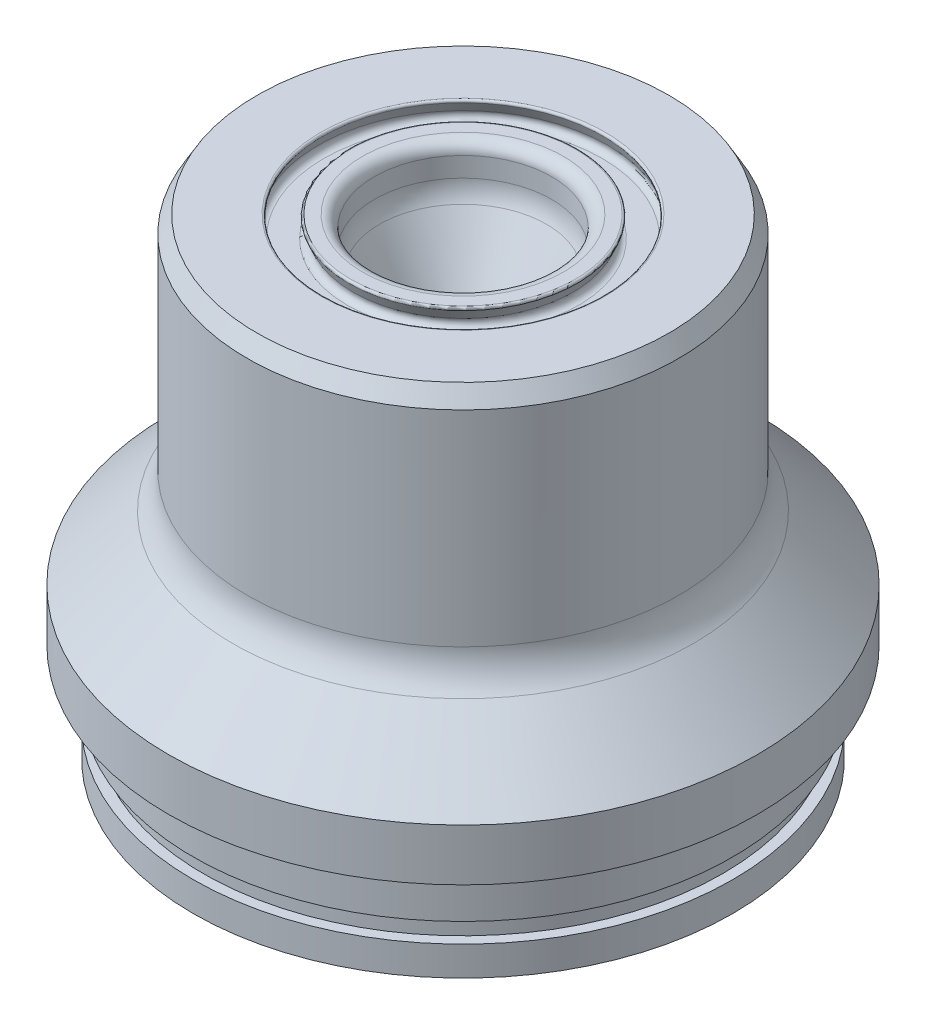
ISO-10303-21;
HEADER;
FILE_DESCRIPTION(('STEP AP214'),'2;1');
FILE_NAME('part.step','',(''),(''),'','','');
FILE_SCHEMA(('AUTOMOTIVE_DESIGN { 1 0 10303 214 1 1 1 1 }'));
ENDSEC;
DATA;
#1=APPLICATION_CONTEXT('core data for automotive mechanical design processes');
#2=APPLICATION_PROTOCOL_DEFINITION('international standard','automotive_design',2000,#1);
#3=PRODUCT_CONTEXT('',#1,'mechanical');
#4=PRODUCT('Part','Part','',(#3));
#5=PRODUCT_RELATED_PRODUCT_CATEGORY('part','',(#4));
#6=PRODUCT_DEFINITION_FORMATION('','',#4);
#7=PRODUCT_DEFINITION_CONTEXT('part definition',#1,'design');
#8=PRODUCT_DEFINITION('design','',#6,#7);
#9=PRODUCT_DEFINITION_SHAPE('','',#8);
#10=(LENGTH_UNIT() NAMED_UNIT(*) SI_UNIT(.MILLI.,.METRE.));
#11=(NAMED_UNIT(*) PLANE_ANGLE_UNIT() SI_UNIT($,.RADIAN.));
#12=(NAMED_UNIT(*) SI_UNIT($,.STERADIAN.) SOLID_ANGLE_UNIT());
#13=UNCERTAINTY_MEASURE_WITH_UNIT(LENGTH_MEASURE(1.E-05),#10,'distance_accuracy_value','');
#14=(GEOMETRIC_REPRESENTATION_CONTEXT(3) GLOBAL_UNCERTAINTY_ASSIGNED_CONTEXT((#13)) GLOBAL_UNIT_ASSIGNED_CONTEXT((#10,
#11,#12)) REPRESENTATION_CONTEXT('',''));
#15=CARTESIAN_POINT('',(0.,0.,0.));
#16=DIRECTION('',(0.,0.,1.));
#17=DIRECTION('',(1.,0.,0.));
#18=AXIS2_PLACEMENT_3D('',#15,#16,#17);
#19=CARTESIAN_POINT('',(-17.4625,-24.638,0.));
#20=DIRECTION('',(0.,-1.,0.));
#21=DIRECTION('',(1.,0.,0.));
#22=AXIS2_PLACEMENT_3D('',#19,#20,#21);
#23=PLANE('',#22);
#24=CARTESIAN_POINT('',(0.,-24.638,0.));
#25=DIRECTION('',(0.,1.,0.));
#26=DIRECTION('',(-1.,0.,0.));
#27=AXIS2_PLACEMENT_3D('',#24,#25,#26);
#28=CIRCLE('',#27,19.05);
#29=CARTESIAN_POINT('',(-19.05,-24.638,0.));
#30=VERTEX_POINT('',#29);
#31=EDGE_CURVE('E151',#30,#30,#28,.T.);
#32=ORIENTED_EDGE('',*,*,#31,.F.);
#33=EDGE_LOOP('',(#32));
#34=FACE_BOUND('',#33,.T.);
#35=CARTESIAN_POINT('',(0.,-24.638,0.));
#36=DIRECTION('',(0.,1.,0.));
#37=DIRECTION('',(-1.,0.,0.));
#38=AXIS2_PLACEMENT_3D('',#35,#36,#37);
#39=CIRCLE('',#38,17.4625);
#40=CARTESIAN_POINT('',(-17.4392920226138,-24.638,0.9));
#41=VERTEX_POINT('',#40);
#42=CARTESIAN_POINT('',(-17.4392920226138,-24.638,-0.899999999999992));
#43=VERTEX_POINT('',#42);
#44=EDGE_CURVE('E149',#41,#43,#39,.T.);
#45=ORIENTED_EDGE('',*,*,#44,.T.);
#46=DIRECTION('',(1.,0.,0.));
#47=VECTOR('',#46,1.);
#48=CARTESIAN_POINT('',(-18.05,-24.638,-0.9));
#49=LINE('',#48,#47);
#50=CARTESIAN_POINT('',(-18.05,-24.638,-0.9));
#51=VERTEX_POINT('',#50);
#52=EDGE_CURVE('E64',#51,#43,#49,.T.);
#53=ORIENTED_EDGE('',*,*,#52,.F.);
#54=CARTESIAN_POINT('',(-18.05,-24.638,0.));
#55=DIRECTION('',(0.,-1.,0.));
#56=DIRECTION('',(1.,0.,0.));
#57=AXIS2_PLACEMENT_3D('',#54,#55,#56);
#58=CIRCLE('',#57,0.9);
#59=CARTESIAN_POINT('',(-18.05,-24.638,0.9));
#60=VERTEX_POINT('',#59);
#61=EDGE_CURVE('E69',#60,#51,#58,.T.);
#62=ORIENTED_EDGE('',*,*,#61,.F.);
#63=DIRECTION('',(-1.,0.,0.));
#64=VECTOR('',#63,1.);
#65=CARTESIAN_POINT('',(-18.05,-24.638,0.9));
#66=LINE('',#65,#64);
#67=EDGE_CURVE('E106',#41,#60,#66,.T.);
#68=ORIENTED_EDGE('',*,*,#67,.F.);
#69=EDGE_LOOP('',(#45,#53,#62,#68));
#70=FACE_BOUND('',#69,.T.);
#71=ADVANCED_FACE('F49',(#34,#70),#23,.T.);
#72=CARTESIAN_POINT('',(0.,0.,0.));
#73=DIRECTION('',(0.,1.,0.));
#74=DIRECTION('',(-1.,0.,0.));
#75=AXIS2_PLACEMENT_3D('',#72,#73,#74);
#76=CYLINDRICAL_SURFACE('',#75,17.4625);
#77=CARTESIAN_POINT('',(0.,-27.813,0.));
#78=DIRECTION('',(0.,1.,0.));
#79=DIRECTION('',(-1.,0.,0.));
#80=AXIS2_PLACEMENT_3D('',#77,#78,#79);
#81=CIRCLE('',#80,17.4625);
#82=CARTESIAN_POINT('',(-17.4392920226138,-27.813,0.9));
#83=VERTEX_POINT('',#82);
#84=CARTESIAN_POINT('',(-17.4392920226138,-27.813,-0.899999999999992));
#85=VERTEX_POINT('',#84);
#86=EDGE_CURVE('E147',#83,#85,#81,.T.);
#87=ORIENTED_EDGE('',*,*,#86,.T.);
#88=DIRECTION('',(0.,1.,0.));
#89=VECTOR('',#88,1.);
#90=CARTESIAN_POINT('',(-17.4392920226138,-27.813,-0.899999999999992));
#91=LINE('',#90,#89);
#92=EDGE_CURVE('E95',#85,#43,#91,.T.);
#93=ORIENTED_EDGE('',*,*,#92,.T.);
#94=ORIENTED_EDGE('',*,*,#44,.F.);
#95=DIRECTION('',(0.,1.,0.));
#96=VECTOR('',#95,1.);
#97=CARTESIAN_POINT('',(-17.4392920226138,-27.813,0.9));
#98=LINE('',#97,#96);
#99=EDGE_CURVE('E114',#83,#41,#98,.T.);
#100=ORIENTED_EDGE('',*,*,#99,.F.);
#101=EDGE_LOOP('',(#87,#93,#94,#100));
#102=FACE_BOUND('',#101,.T.);
#103=ADVANCED_FACE('F235',(#102),#76,.T.);
#104=CARTESIAN_POINT('',(0.,-16.2052,0.));
#105=DIRECTION('',(0.,1.,0.));
#106=DIRECTION('',(0.,0.,1.));
#107=AXIS2_PLACEMENT_3D('',#104,#105,#106);
#108=PLANE('',#107);
#109=CARTESIAN_POINT('',(0.,-16.2052,0.));
#110=DIRECTION('',(0.,1.,0.));
#111=DIRECTION('',(0.,0.,1.));
#112=AXIS2_PLACEMENT_3D('',#109,#110,#111);
#113=CIRCLE('',#112,7.74764143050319);
#114=CARTESIAN_POINT('',(0.,-16.2052,7.74764143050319));
#115=VERTEX_POINT('',#114);
#116=EDGE_CURVE('E217',#115,#115,#113,.F.);
#117=ORIENTED_EDGE('',*,*,#116,.T.);
#118=EDGE_LOOP('',(#117));
#119=FACE_BOUND('',#118,.T.);
#120=CARTESIAN_POINT('',(0.,-16.2052,0.));
#121=DIRECTION('',(0.,1.,0.));
#122=DIRECTION('',(0.,0.,1.));
#123=AXIS2_PLACEMENT_3D('',#120,#121,#122);
#124=CIRCLE('',#123,2.51123484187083);
#125=CARTESIAN_POINT('',(0.,-16.2052,2.51123484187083));
#126=VERTEX_POINT('',#125);
#127=EDGE_CURVE('E202',#126,#126,#124,.T.);
#128=ORIENTED_EDGE('',*,*,#127,.T.);
#129=EDGE_LOOP('',(#128));
#130=FACE_BOUND('',#129,.T.);
#131=ADVANCED_FACE('F241',(#119,#130),#108,.F.);
#132=CARTESIAN_POINT('',(0.,-0.508000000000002,0.));
#133=DIRECTION('',(0.,1.,0.));
#134=DIRECTION('',(0.,0.,1.));
#135=AXIS2_PLACEMENT_3D('',#132,#133,#134);
#136=CYLINDRICAL_SURFACE('',#135,13.97);
#137=CARTESIAN_POINT('',(0.,-14.8900719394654,0.));
#138=DIRECTION('',(0.,1.,0.));
#139=DIRECTION('',(-1.,0.,0.));
#140=AXIS2_PLACEMENT_3D('',#137,#138,#139);
#141=CIRCLE('',#140,13.97);
#142=CARTESIAN_POINT('',(-13.97,-14.8900719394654,0.));
#143=VERTEX_POINT('',#142);
#144=EDGE_CURVE('E208',#143,#143,#141,.T.);
#145=ORIENTED_EDGE('',*,*,#144,.T.);
#146=EDGE_LOOP('',(#145));
#147=FACE_BOUND('',#146,.T.);
#148=CARTESIAN_POINT('',(0.,-1.60785226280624,0.));
#149=DIRECTION('',(0.,-1.,0.));
#150=DIRECTION('',(0.,0.,-1.));
#151=AXIS2_PLACEMENT_3D('',#148,#149,#150);
#152=CIRCLE('',#151,13.97);
#153=CARTESIAN_POINT('',(0.,-1.60785226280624,-13.97));
#154=VERTEX_POINT('',#153);
#155=EDGE_CURVE('E199',#154,#154,#152,.T.);
#156=ORIENTED_EDGE('',*,*,#155,.T.);
#157=EDGE_LOOP('',(#156));
#158=FACE_BOUND('',#157,.T.);
#159=ADVANCED_FACE('F315',(#147,#158),#136,.T.);
#160=CARTESIAN_POINT('',(9.19986285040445,-0.508000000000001,0.));
#161=DIRECTION('',(0.,-1.,0.));
#162=DIRECTION('',(0.,0.,-1.));
#163=AXIS2_PLACEMENT_3D('',#160,#161,#162);
#164=PLANE('',#163);
#165=CARTESIAN_POINT('',(0.,-0.508000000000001,0.));
#166=DIRECTION('',(0.,-1.,0.));
#167=DIRECTION('',(0.,0.,-1.));
#168=AXIS2_PLACEMENT_3D('',#165,#166,#167);
#169=CIRCLE('',#168,13.335);
#170=CARTESIAN_POINT('',(0.,-0.508000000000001,-13.335));
#171=VERTEX_POINT('',#170);
#172=EDGE_CURVE('E196',#171,#171,#169,.F.);
#173=ORIENTED_EDGE('',*,*,#172,.T.);
#174=EDGE_LOOP('',(#173));
#175=FACE_BOUND('',#174,.T.);
#176=CARTESIAN_POINT('',(0.,-0.508,0.));
#177=DIRECTION('',(0.,1.,0.));
#178=DIRECTION('',(0.,0.,1.));
#179=AXIS2_PLACEMENT_3D('',#176,#177,#178);
#180=CIRCLE('',#179,9.19986285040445);
#181=CARTESIAN_POINT('',(0.,-0.508,9.19986285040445));
#182=VERTEX_POINT('',#181);
#183=EDGE_CURVE('E193',#182,#182,#180,.T.);
#184=ORIENTED_EDGE('',*,*,#183,.F.);
#185=EDGE_LOOP('',(#184));
#186=FACE_BOUND('',#185,.T.);
#187=ADVANCED_FACE('F311',(#175,#186),#164,.F.);
#188=CARTESIAN_POINT('',(0.,-0.635,0.));
#189=DIRECTION('',(0.,1.,0.));
#190=DIRECTION('',(0.,0.,1.));
#191=AXIS2_PLACEMENT_3D('',#188,#189,#190);
#192=TOROIDAL_SURFACE('',#191,9.19986285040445,0.127);
#193=CARTESIAN_POINT('',(0.,-0.686655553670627,0.));
#194=DIRECTION('',(0.,1.,0.));
#195=DIRECTION('',(0.,0.,1.));
#196=AXIS2_PLACEMENT_3D('',#193,#194,#195);
#197=CIRCLE('',#196,9.08384257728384);
#198=CARTESIAN_POINT('',(0.,-0.686655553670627,9.08384257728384));
#199=VERTEX_POINT('',#198);
#200=EDGE_CURVE('E190',#199,#199,#197,.T.);
#201=ORIENTED_EDGE('',*,*,#200,.F.);
#202=EDGE_LOOP('',(#201));
#203=FACE_BOUND('',#202,.T.);
#204=ORIENTED_EDGE('',*,*,#183,.T.);
#205=EDGE_LOOP('',(#204));
#206=FACE_BOUND('',#205,.T.);
#207=ADVANCED_FACE('F307',(#203,#206),#192,.T.);
#208=CARTESIAN_POINT('',(0.,-0.686655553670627,0.));
#209=DIRECTION('',(0.,-1.,0.));
#210=DIRECTION('',(0.,0.,-1.));
#211=AXIS2_PLACEMENT_3D('',#208,#209,#210);
#212=CONICAL_SURFACE('',#211,9.08384257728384,0.418879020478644);
#213=CARTESIAN_POINT('',(0.,-1.32130139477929,0.));
#214=DIRECTION('',(0.,1.,0.));
#215=DIRECTION('',(0.,0.,1.));
#216=AXIS2_PLACEMENT_3D('',#213,#214,#215);
#217=CIRCLE('',#216,9.36640511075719);
#218=CARTESIAN_POINT('',(0.,-1.32130139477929,9.36640511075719));
#219=VERTEX_POINT('',#218);
#220=EDGE_CURVE('E187',#219,#219,#217,.T.);
#221=ORIENTED_EDGE('',*,*,#220,.F.);
#222=EDGE_LOOP('',(#221));
#223=FACE_BOUND('',#222,.T.);
#224=ORIENTED_EDGE('',*,*,#200,.T.);
#225=EDGE_LOOP('',(#224));
#226=FACE_BOUND('',#225,.T.);
#227=ADVANCED_FACE('F303',(#223,#226),#212,.F.);
#228=CARTESIAN_POINT('',(0.,-1.482725,0.));
#229=DIRECTION('',(0.,1.,0.));
#230=DIRECTION('',(0.,0.,1.));
#231=AXIS2_PLACEMENT_3D('',#228,#229,#230);
#232=TOROIDAL_SURFACE('',#231,9.00384175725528,0.396875);
#233=CARTESIAN_POINT('',(0.,-1.8796,0.));
#234=DIRECTION('',(0.,1.,0.));
#235=DIRECTION('',(0.,0.,1.));
#236=AXIS2_PLACEMENT_3D('',#233,#234,#235);
#237=CIRCLE('',#236,9.00384175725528);
#238=CARTESIAN_POINT('',(0.,-1.8796,9.00384175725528));
#239=VERTEX_POINT('',#238);
#240=EDGE_CURVE('E184',#239,#239,#237,.T.);
#241=ORIENTED_EDGE('',*,*,#240,.F.);
#242=EDGE_LOOP('',(#241));
#243=FACE_BOUND('',#242,.T.);
#244=ORIENTED_EDGE('',*,*,#220,.T.);
#245=EDGE_LOOP('',(#244));
#246=FACE_BOUND('',#245,.T.);
#247=ADVANCED_FACE('F299',(#243,#246),#232,.F.);
#248=CARTESIAN_POINT('',(9.00384175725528,-1.8796,0.));
#249=DIRECTION('',(0.,-1.,0.));
#250=DIRECTION('',(0.,0.,-1.));
#251=AXIS2_PLACEMENT_3D('',#248,#249,#250);
#252=PLANE('',#251);
#253=CARTESIAN_POINT('',(0.,-1.8796,0.));
#254=DIRECTION('',(0.,1.,0.));
#255=DIRECTION('',(0.,0.,1.));
#256=AXIS2_PLACEMENT_3D('',#253,#254,#255);
#257=CIRCLE('',#256,7.48075824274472);
#258=CARTESIAN_POINT('',(0.,-1.8796,7.48075824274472));
#259=VERTEX_POINT('',#258);
#260=EDGE_CURVE('E181',#259,#259,#257,.T.);
#261=ORIENTED_EDGE('',*,*,#260,.F.);
#262=EDGE_LOOP('',(#261));
#263=FACE_BOUND('',#262,.T.);
#264=ORIENTED_EDGE('',*,*,#240,.T.);
#265=EDGE_LOOP('',(#264));
#266=FACE_BOUND('',#265,.T.);
#267=ADVANCED_FACE('F295',(#263,#266),#252,.F.);
#268=CARTESIAN_POINT('',(0.,-1.482725,0.));
#269=DIRECTION('',(0.,1.,0.));
#270=DIRECTION('',(0.,0.,1.));
#271=AXIS2_PLACEMENT_3D('',#268,#269,#270);
#272=TOROIDAL_SURFACE('',#271,7.48075824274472,0.396875);
#273=CARTESIAN_POINT('',(0.,-1.32130139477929,0.));
#274=DIRECTION('',(0.,1.,0.));
#275=DIRECTION('',(0.,0.,1.));
#276=AXIS2_PLACEMENT_3D('',#273,#274,#275);
#277=CIRCLE('',#276,7.11819488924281);
#278=CARTESIAN_POINT('',(0.,-1.32130139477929,7.11819488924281));
#279=VERTEX_POINT('',#278);
#280=EDGE_CURVE('E178',#279,#279,#277,.T.);
#281=ORIENTED_EDGE('',*,*,#280,.F.);
#282=EDGE_LOOP('',(#281));
#283=FACE_BOUND('',#282,.T.);
#284=ORIENTED_EDGE('',*,*,#260,.T.);
#285=EDGE_LOOP('',(#284));
#286=FACE_BOUND('',#285,.T.);
#287=ADVANCED_FACE('F291',(#283,#286),#272,.F.);
#288=CARTESIAN_POINT('',(0.,-1.32130139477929,0.));
#289=DIRECTION('',(0.,1.,0.));
#290=DIRECTION('',(0.,0.,1.));
#291=AXIS2_PLACEMENT_3D('',#288,#289,#290);
#292=CONICAL_SURFACE('',#291,7.11819488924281,0.418879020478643);
#293=CARTESIAN_POINT('',(0.,-0.686655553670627,0.));
#294=DIRECTION('',(0.,1.,0.));
#295=DIRECTION('',(0.,0.,1.));
#296=AXIS2_PLACEMENT_3D('',#293,#294,#295);
#297=CIRCLE('',#296,7.40075742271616);
#298=CARTESIAN_POINT('',(0.,-0.686655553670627,7.40075742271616));
#299=VERTEX_POINT('',#298);
#300=EDGE_CURVE('E175',#299,#299,#297,.T.);
#301=ORIENTED_EDGE('',*,*,#300,.F.);
#302=EDGE_LOOP('',(#301));
#303=FACE_BOUND('',#302,.T.);
#304=ORIENTED_EDGE('',*,*,#280,.T.);
#305=EDGE_LOOP('',(#304));
#306=FACE_BOUND('',#305,.T.);
#307=ADVANCED_FACE('F287',(#303,#306),#292,.T.);
#308=CARTESIAN_POINT('',(0.,-0.635,0.));
#309=DIRECTION('',(0.,1.,0.));
#310=DIRECTION('',(0.,0.,1.));
#311=AXIS2_PLACEMENT_3D('',#308,#309,#310);
#312=TOROIDAL_SURFACE('',#311,7.28473714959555,0.127);
#313=CARTESIAN_POINT('',(0.,-0.508,0.));
#314=DIRECTION('',(0.,1.,0.));
#315=DIRECTION('',(0.,0.,1.));
#316=AXIS2_PLACEMENT_3D('',#313,#314,#315);
#317=CIRCLE('',#316,7.28473714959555);
#318=CARTESIAN_POINT('',(0.,-0.508,7.28473714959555));
#319=VERTEX_POINT('',#318);
#320=EDGE_CURVE('E172',#319,#319,#317,.T.);
#321=ORIENTED_EDGE('',*,*,#320,.F.);
#322=EDGE_LOOP('',(#321));
#323=FACE_BOUND('',#322,.T.);
#324=ORIENTED_EDGE('',*,*,#300,.T.);
#325=EDGE_LOOP('',(#324));
#326=FACE_BOUND('',#325,.T.);
#327=ADVANCED_FACE('F283',(#323,#326),#312,.T.);
#328=CARTESIAN_POINT('',(7.28473714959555,-0.508000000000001,0.));
#329=DIRECTION('',(0.,-1.,0.));
#330=DIRECTION('',(0.,0.,-1.));
#331=AXIS2_PLACEMENT_3D('',#328,#329,#330);
#332=PLANE('',#331);
#333=CARTESIAN_POINT('',(0.,-0.508000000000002,0.));
#334=DIRECTION('',(0.,1.,0.));
#335=DIRECTION('',(0.,0.,1.));
#336=AXIS2_PLACEMENT_3D('',#333,#334,#335);
#337=CIRCLE('',#336,6.49878528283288);
#338=CARTESIAN_POINT('',(0.,-0.508000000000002,6.49878528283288));
#339=VERTEX_POINT('',#338);
#340=EDGE_CURVE('E169',#339,#339,#337,.T.);
#341=ORIENTED_EDGE('',*,*,#340,.F.);
#342=EDGE_LOOP('',(#341));
#343=FACE_BOUND('',#342,.T.);
#344=ORIENTED_EDGE('',*,*,#320,.T.);
#345=EDGE_LOOP('',(#344));
#346=FACE_BOUND('',#345,.T.);
#347=ADVANCED_FACE('F279',(#343,#346),#332,.F.);
#348=CARTESIAN_POINT('',(0.,-1.27,0.));
#349=DIRECTION('',(0.,1.,0.));
#350=DIRECTION('',(0.,0.,1.));
#351=AXIS2_PLACEMENT_3D('',#348,#349,#350);
#352=TOROIDAL_SURFACE('',#351,6.49878528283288,0.761999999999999);
#353=CARTESIAN_POINT('',(0.,-1.27,0.));
#354=DIRECTION('',(0.,1.,0.));
#355=DIRECTION('',(0.,0.,1.));
#356=AXIS2_PLACEMENT_3D('',#353,#354,#355);
#357=CIRCLE('',#356,5.73678528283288);
#358=CARTESIAN_POINT('',(0.,-1.27,5.73678528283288));
#359=VERTEX_POINT('',#358);
#360=EDGE_CURVE('E166',#359,#359,#357,.T.);
#361=ORIENTED_EDGE('',*,*,#360,.F.);
#362=EDGE_LOOP('',(#361));
#363=FACE_BOUND('',#362,.T.);
#364=ORIENTED_EDGE('',*,*,#340,.T.);
#365=EDGE_LOOP('',(#364));
#366=FACE_BOUND('',#365,.T.);
#367=ADVANCED_FACE('F275',(#363,#366),#352,.T.);
#368=CARTESIAN_POINT('',(0.,-0.508000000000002,0.));
#369=DIRECTION('',(0.,1.,0.));
#370=DIRECTION('',(0.,0.,1.));
#371=AXIS2_PLACEMENT_3D('',#368,#369,#370);
#372=CYLINDRICAL_SURFACE('',#371,5.73678528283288);
#373=CARTESIAN_POINT('',(0.,-2.54,0.));
#374=DIRECTION('',(0.,1.,0.));
#375=DIRECTION('',(0.,0.,1.));
#376=AXIS2_PLACEMENT_3D('',#373,#374,#375);
#377=CIRCLE('',#376,5.73678528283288);
#378=CARTESIAN_POINT('',(0.,-2.54,5.73678528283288));
#379=VERTEX_POINT('',#378);
#380=EDGE_CURVE('E163',#379,#379,#377,.T.);
#381=ORIENTED_EDGE('',*,*,#380,.F.);
#382=EDGE_LOOP('',(#381));
#383=FACE_BOUND('',#382,.T.);
#384=ORIENTED_EDGE('',*,*,#360,.T.);
#385=EDGE_LOOP('',(#384));
#386=FACE_BOUND('',#385,.T.);
#387=ADVANCED_FACE('F271',(#383,#386),#372,.F.);
#388=CARTESIAN_POINT('',(0.,-2.54,0.));
#389=DIRECTION('',(0.,1.,0.));
#390=DIRECTION('',(0.,0.,1.));
#391=AXIS2_PLACEMENT_3D('',#388,#389,#390);
#392=TOROIDAL_SURFACE('',#391,3.19678528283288,2.54);
#393=CARTESIAN_POINT('',(0.,-3.77909119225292,0.));
#394=DIRECTION('',(0.,1.,0.));
#395=DIRECTION('',(0.,0.,1.));
#396=AXIS2_PLACEMENT_3D('',#393,#394,#395);
#397=CIRCLE('',#396,5.41404778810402);
#398=CARTESIAN_POINT('',(0.,-3.77909119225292,5.41404778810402));
#399=VERTEX_POINT('',#398);
#400=EDGE_CURVE('E160',#399,#399,#397,.T.);
#401=ORIENTED_EDGE('',*,*,#400,.F.);
#402=EDGE_LOOP('',(#401));
#403=FACE_BOUND('',#402,.T.);
#404=ORIENTED_EDGE('',*,*,#380,.T.);
#405=EDGE_LOOP('',(#404));
#406=FACE_BOUND('',#405,.T.);
#407=ADVANCED_FACE('F267',(#403,#406),#392,.F.);
#408=CARTESIAN_POINT('',(0.,-3.77909119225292,0.));
#409=DIRECTION('',(0.,1.,0.));
#410=DIRECTION('',(0.,0.,1.));
#411=AXIS2_PLACEMENT_3D('',#408,#409,#410);
#412=CONICAL_SURFACE('',#411,5.41404778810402,0.509603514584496);
#413=CARTESIAN_POINT('',(0.,-11.6945254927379,0.));
#414=DIRECTION('',(0.,-1.,0.));
#415=DIRECTION('',(0.,0.,-1.));
#416=AXIS2_PLACEMENT_3D('',#413,#414,#415);
#417=CIRCLE('',#416,0.9906);
#418=CARTESIAN_POINT('',(0.,-11.6945254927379,0.990600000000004));
#419=VERTEX_POINT('',#418);
#420=EDGE_CURVE('E157',#419,#419,#417,.F.);
#421=CARTESIAN_POINT('',(0.,-11.6945254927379,0.990600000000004));
#422=CARTESIAN_POINT('',(0.,-11.6120730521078,1.03667758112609));
#423=CARTESIAN_POINT('',(0.,-11.5296206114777,1.08275516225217));
#424=CARTESIAN_POINT('',(0.,-11.3647157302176,1.17491032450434));
#425=CARTESIAN_POINT('',(0.,-11.2822632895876,1.22098790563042));
#426=CARTESIAN_POINT('',(0.,-11.1173584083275,1.31314306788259));
#427=CARTESIAN_POINT('',(0.,-11.0349059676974,1.35922064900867));
#428=CARTESIAN_POINT('',(0.,-10.8700010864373,1.45137581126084));
#429=CARTESIAN_POINT('',(0.,-10.7875486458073,1.49745339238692));
#430=CARTESIAN_POINT('',(0.,-10.6226437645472,1.58960855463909));
#431=CARTESIAN_POINT('',(0.,-10.5401913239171,1.63568613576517));
#432=CARTESIAN_POINT('',(0.,-10.375286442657,1.72784129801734));
#433=CARTESIAN_POINT('',(0.,-10.292834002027,1.77391887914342));
#434=CARTESIAN_POINT('',(0.,-10.1279291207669,1.86607404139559));
#435=CARTESIAN_POINT('',(0.,-10.0454766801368,1.91215162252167));
#436=CARTESIAN_POINT('',(0.,-9.88057179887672,2.00430678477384));
#437=CARTESIAN_POINT('',(0.,-9.79811935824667,2.05038436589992));
#438=CARTESIAN_POINT('',(0.,-9.63321447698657,2.14253952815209));
#439=CARTESIAN_POINT('',(0.,-9.55076203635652,2.18861710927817));
#440=CARTESIAN_POINT('',(0.,-9.38585715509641,2.28077227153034));
#441=CARTESIAN_POINT('',(0.,-9.30340471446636,2.32684985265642));
#442=CARTESIAN_POINT('',(0.,-9.13849983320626,2.41900501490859));
#443=CARTESIAN_POINT('',(0.,-9.05604739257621,2.46508259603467));
#444=CARTESIAN_POINT('',(0.,-8.89114251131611,2.55723775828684));
#445=CARTESIAN_POINT('',(0.,-8.80869007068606,2.60331533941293));
#446=CARTESIAN_POINT('',(0.,-8.64378518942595,2.69547050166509));
#447=CARTESIAN_POINT('',(0.,-8.5613327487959,2.74154808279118));
#448=CARTESIAN_POINT('',(0.,-8.3964278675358,2.83370324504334));
#449=CARTESIAN_POINT('',(0.,-8.31397542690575,2.87978082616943));
#450=CARTESIAN_POINT('',(0.,-8.14907054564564,2.97193598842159));
#451=CARTESIAN_POINT('',(0.,-8.06661810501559,3.01801356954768));
#452=CARTESIAN_POINT('',(0.,-7.90171322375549,3.11016873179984));
#453=CARTESIAN_POINT('',(0.,-7.81926078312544,3.15624631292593));
#454=CARTESIAN_POINT('',(0.,-7.65435590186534,3.24840147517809));
#455=CARTESIAN_POINT('',(0.,-7.57190346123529,3.29447905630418));
#456=CARTESIAN_POINT('',(0.,-7.40699857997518,3.38663421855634));
#457=CARTESIAN_POINT('',(0.,-7.32454613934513,3.43271179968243));
#458=CARTESIAN_POINT('',(0.,-7.15964125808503,3.52486696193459));
#459=CARTESIAN_POINT('',(0.,-7.07718881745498,3.57094454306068));
#460=CARTESIAN_POINT('',(0.,-6.91228393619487,3.66309970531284));
#461=CARTESIAN_POINT('',(0.,-6.82983149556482,3.70917728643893));
#462=CARTESIAN_POINT('',(0.,-6.66492661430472,3.80133244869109));
#463=CARTESIAN_POINT('',(0.,-6.58247417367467,3.84741002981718));
#464=CARTESIAN_POINT('',(0.,-6.41756929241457,3.93956519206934));
#465=CARTESIAN_POINT('',(0.,-6.33511685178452,3.98564277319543));
#466=CARTESIAN_POINT('',(0.,-6.17021197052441,4.0777979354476));
#467=CARTESIAN_POINT('',(0.,-6.08775952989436,4.12387551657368));
#468=CARTESIAN_POINT('',(0.,-5.92285464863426,4.21603067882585));
#469=CARTESIAN_POINT('',(0.,-5.84040220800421,4.26210825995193));
#470=CARTESIAN_POINT('',(0.,-5.67549732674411,4.3542634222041));
#471=CARTESIAN_POINT('',(0.,-5.59304488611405,4.40034100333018));
#472=CARTESIAN_POINT('',(0.,-5.42814000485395,4.49249616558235));
#473=CARTESIAN_POINT('',(0.,-5.3456875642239,4.53857374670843));
#474=CARTESIAN_POINT('',(0.,-5.1807826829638,4.6307289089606));
#475=CARTESIAN_POINT('',(0.,-5.09833024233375,4.67680649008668));
#476=CARTESIAN_POINT('',(0.,-4.93342536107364,4.76896165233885));
#477=CARTESIAN_POINT('',(0.,-4.85097292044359,4.81503923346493));
#478=CARTESIAN_POINT('',(0.,-4.68606803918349,4.9071943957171));
#479=CARTESIAN_POINT('',(0.,-4.60361559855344,4.95327197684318));
#480=CARTESIAN_POINT('',(0.,-4.43871071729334,5.04542713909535));
#481=CARTESIAN_POINT('',(0.,-4.35625827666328,5.09150472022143));
#482=CARTESIAN_POINT('',(0.,-4.19135339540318,5.1836598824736));
#483=CARTESIAN_POINT('',(0.,-4.10890095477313,5.22973746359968));
#484=CARTESIAN_POINT('',(0.,-3.94399607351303,5.32189262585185));
#485=CARTESIAN_POINT('',(0.,-3.86154363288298,5.36797020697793));
#486=CARTESIAN_POINT('',(0.,-3.77909119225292,5.41404778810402));
#487=B_SPLINE_CURVE_WITH_KNOTS('',3,(#421,#422,#423,#424,#425,#426,#427,#428,#429,#430,#431,
#432,#433,#434,#435,#436,#437,#438,#439,#440,#441,#442,#443,#444,#445,#446,#447,#448,#449,#450,
#451,#452,#453,#454,#455,#456,#457,#458,#459,#460,#461,#462,#463,#464,#465,#466,#467,#468,#469,
#470,#471,#472,#473,#474,#475,#476,#477,#478,#479,#480,#481,#482,#483,#484,#485,#486),
.UNSPECIFIED.,.F.,.F.,(4,2,2,2,2,2,2,2,2,2,2,2,2,2,2,2,2,2,2,2,2,2,2,2,2,2,2,2,2,2,2,2,4),(0.,
0.283361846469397,0.566723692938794,0.850085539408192,1.13344738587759,1.41680923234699,
1.70017107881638,1.98353292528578,2.26689477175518,2.55025661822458,2.83361846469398,
3.11698031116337,3.40034215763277,3.68370400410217,3.96706585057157,4.25042769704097,
4.53378954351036,4.81715138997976,5.10051323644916,5.38387508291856,5.66723692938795,
5.95059877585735,6.23396062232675,6.51732246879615,6.80068431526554,7.08404616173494,
7.36740800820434,7.65076985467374,7.93413170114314,8.21749354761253,8.50085539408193,
8.78421724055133,9.06757908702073),.UNSPECIFIED.);
#488=EDGE_CURVE('BSEAM263',#419,#399,#487,.T.);
#489=ORIENTED_EDGE('',*,*,#420,.F.);
#490=ORIENTED_EDGE('',*,*,#400,.T.);
#491=ORIENTED_EDGE('',*,*,#488,.T.);
#492=ORIENTED_EDGE('',*,*,#488,.F.);
#493=EDGE_LOOP('',(#489,#491,#490,#492));
#494=FACE_BOUND('',#493,.T.);
#495=ADVANCED_FACE('F263',(#494),#412,.F.);
#496=CARTESIAN_POINT('',(0.,-6.69452549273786,0.));
#497=DIRECTION('',(0.,-1.,0.));
#498=DIRECTION('',(1.,0.,0.));
#499=AXIS2_PLACEMENT_3D('',#496,#497,#498);
#500=CYLINDRICAL_SURFACE('',#499,0.9906);
#501=ORIENTED_EDGE('',*,*,#420,.T.);
#502=EDGE_LOOP('',(#501));
#503=FACE_BOUND('',#502,.T.);
#504=CARTESIAN_POINT('',(0.,-25.3492,0.));
#505=DIRECTION('',(0.,1.,0.));
#506=DIRECTION('',(-1.,0.,0.));
#507=AXIS2_PLACEMENT_3D('',#504,#505,#506);
#508=CIRCLE('',#507,0.990599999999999);
#509=CARTESIAN_POINT('',(-0.990599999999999,-25.3492,0.));
#510=VERTEX_POINT('',#509);
#511=EDGE_CURVE('E109',#510,#510,#508,.T.);
#512=ORIENTED_EDGE('',*,*,#511,.F.);
#513=EDGE_LOOP('',(#512));
#514=FACE_BOUND('',#513,.T.);
#515=ADVANCED_FACE('F260',(#503,#514),#500,.F.);
#516=CARTESIAN_POINT('',(0.,-0.508000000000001,0.));
#517=DIRECTION('',(0.,-1.,0.));
#518=DIRECTION('',(0.,0.,-1.));
#519=AXIS2_PLACEMENT_3D('',#516,#517,#518);
#520=CONICAL_SURFACE('',#519,13.335,0.5235987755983);
#521=ORIENTED_EDGE('',*,*,#155,.F.);
#522=EDGE_LOOP('',(#521));
#523=FACE_BOUND('',#522,.T.);
#524=ORIENTED_EDGE('',*,*,#172,.F.);
#525=EDGE_LOOP('',(#524));
#526=FACE_BOUND('',#525,.T.);
#527=ADVANCED_FACE('F258',(#523,#526),#520,.T.);
#528=CARTESIAN_POINT('',(0.,-21.0673024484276,0.));
#529=DIRECTION('',(0.,-1.,0.));
#530=DIRECTION('',(1.,0.,0.));
#531=AXIS2_PLACEMENT_3D('',#528,#529,#530);
#532=CONICAL_SURFACE('',#531,15.24,0.78539816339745);
#533=CARTESIAN_POINT('',(0.,-19.2074305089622,0.));
#534=DIRECTION('',(0.,-1.,0.));
#535=DIRECTION('',(1.,0.,0.));
#536=AXIS2_PLACEMENT_3D('',#533,#534,#535);
#537=CIRCLE('',#536,13.3801280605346);
#538=CARTESIAN_POINT('',(13.3801280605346,-19.2074305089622,0.));
#539=VERTEX_POINT('',#538);
#540=EDGE_CURVE('E12',#539,#539,#537,.T.);
#541=ORIENTED_EDGE('',*,*,#540,.T.);
#542=EDGE_LOOP('',(#541));
#543=FACE_BOUND('',#542,.T.);
#544=CARTESIAN_POINT('',(0.,-18.0650719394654,0.));
#545=DIRECTION('',(0.,1.,0.));
#546=DIRECTION('',(0.,0.,1.));
#547=AXIS2_PLACEMENT_3D('',#544,#545,#546);
#548=CIRCLE('',#547,12.2377694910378);
#549=CARTESIAN_POINT('',(0.,-18.0650719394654,12.2377694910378));
#550=VERTEX_POINT('',#549);
#551=EDGE_CURVE('E214',#550,#550,#548,.T.);
#552=ORIENTED_EDGE('',*,*,#551,.T.);
#553=EDGE_LOOP('',(#552));
#554=FACE_BOUND('',#553,.T.);
#555=ADVANCED_FACE('F254',(#543,#554),#532,.F.);
#556=CARTESIAN_POINT('',(0.,-16.2052,0.));
#557=DIRECTION('',(0.,-1.,0.));
#558=DIRECTION('',(1.,0.,0.));
#559=AXIS2_PLACEMENT_3D('',#556,#557,#558);
#560=CONICAL_SURFACE('',#559,13.97,0.78539816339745);
#561=CARTESIAN_POINT('',(0.,-17.1351359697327,0.));
#562=DIRECTION('',(0.,1.,0.));
#563=DIRECTION('',(-1.,0.,0.));
#564=AXIS2_PLACEMENT_3D('',#561,#562,#563);
#565=CIRCLE('',#564,14.8999359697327);
#566=CARTESIAN_POINT('',(-14.8999359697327,-17.1351359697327,0.));
#567=VERTEX_POINT('',#566);
#568=EDGE_CURVE('E211',#567,#567,#565,.F.);
#569=ORIENTED_EDGE('',*,*,#568,.T.);
#570=EDGE_LOOP('',(#569));
#571=FACE_BOUND('',#570,.T.);
#572=CARTESIAN_POINT('',(0.,-21.2852,0.));
#573=DIRECTION('',(0.,1.,0.));
#574=DIRECTION('',(-1.,0.,0.));
#575=AXIS2_PLACEMENT_3D('',#572,#573,#574);
#576=CIRCLE('',#575,19.05);
#577=CARTESIAN_POINT('',(-19.05,-21.2852,0.));
#578=VERTEX_POINT('',#577);
#579=EDGE_CURVE('E154',#578,#578,#576,.T.);
#580=ORIENTED_EDGE('',*,*,#579,.T.);
#581=EDGE_LOOP('',(#580));
#582=FACE_BOUND('',#581,.T.);
#583=ADVANCED_FACE('F250',(#571,#582),#560,.T.);
#584=CARTESIAN_POINT('',(0.,0.,0.));
#585=DIRECTION('',(0.,1.,0.));
#586=DIRECTION('',(-1.,0.,0.));
#587=AXIS2_PLACEMENT_3D('',#584,#585,#586);
#588=CYLINDRICAL_SURFACE('',#587,19.05);
#589=ORIENTED_EDGE('',*,*,#31,.T.);
#590=EDGE_LOOP('',(#589));
#591=FACE_BOUND('',#590,.T.);
#592=ORIENTED_EDGE('',*,*,#579,.F.);
#593=EDGE_LOOP('',(#592));
#594=FACE_BOUND('',#593,.T.);
#595=ADVANCED_FACE('F247',(#591,#594),#588,.T.);
#596=CARTESIAN_POINT('',(-16.8021,-27.813,0.));
#597=DIRECTION('',(0.,-1.,0.));
#598=DIRECTION('',(1.,0.,0.));
#599=AXIS2_PLACEMENT_3D('',#596,#597,#598);
#600=PLANE('',#599);
#601=CARTESIAN_POINT('',(0.,-27.813,0.));
#602=DIRECTION('',(0.,1.,0.));
#603=DIRECTION('',(-1.,0.,0.));
#604=AXIS2_PLACEMENT_3D('',#601,#602,#603);
#605=CIRCLE('',#604,16.8021);
#606=CARTESIAN_POINT('',(-16.8021,-27.813,0.));
#607=VERTEX_POINT('',#606);
#608=EDGE_CURVE('E144',#607,#607,#605,.T.);
#609=ORIENTED_EDGE('',*,*,#608,.T.);
#610=EDGE_LOOP('',(#609));
#611=FACE_BOUND('',#610,.T.);
#612=ORIENTED_EDGE('',*,*,#86,.F.);
#613=DIRECTION('',(-1.,0.,0.));
#614=VECTOR('',#613,1.);
#615=CARTESIAN_POINT('',(-18.05,-27.813,0.9));
#616=LINE('',#615,#614);
#617=CARTESIAN_POINT('',(-18.05,-27.813,0.9));
#618=VERTEX_POINT('',#617);
#619=EDGE_CURVE('E97',#83,#618,#616,.T.);
#620=ORIENTED_EDGE('',*,*,#619,.T.);
#621=CARTESIAN_POINT('',(-18.05,-27.813,0.));
#622=DIRECTION('',(0.,-1.,0.));
#623=DIRECTION('',(1.,0.,0.));
#624=AXIS2_PLACEMENT_3D('',#621,#622,#623);
#625=CIRCLE('',#624,0.9);
#626=CARTESIAN_POINT('',(-18.05,-27.813,-0.9));
#627=VERTEX_POINT('',#626);
#628=EDGE_CURVE('E98',#618,#627,#625,.T.);
#629=ORIENTED_EDGE('',*,*,#628,.T.);
#630=DIRECTION('',(1.,0.,0.));
#631=VECTOR('',#630,1.);
#632=CARTESIAN_POINT('',(-18.05,-27.813,-0.9));
#633=LINE('',#632,#631);
#634=EDGE_CURVE('E90',#627,#85,#633,.T.);
#635=ORIENTED_EDGE('',*,*,#634,.T.);
#636=EDGE_LOOP('',(#612,#620,#629,#635));
#637=FACE_BOUND('',#636,.T.);
#638=ADVANCED_FACE('F101',(#611,#637),#600,.T.);
#639=CARTESIAN_POINT('',(0.,0.,0.));
#640=DIRECTION('',(0.,1.,0.));
#641=DIRECTION('',(-1.,0.,0.));
#642=AXIS2_PLACEMENT_3D('',#639,#640,#641);
#643=CYLINDRICAL_SURFACE('',#642,16.8021);
#644=CARTESIAN_POINT('',(0.,-29.083,0.));
#645=DIRECTION('',(0.,1.,0.));
#646=DIRECTION('',(-1.,0.,0.));
#647=AXIS2_PLACEMENT_3D('',#644,#645,#646);
#648=CIRCLE('',#647,16.8021);
#649=CARTESIAN_POINT('',(-16.8021,-29.083,0.));
#650=VERTEX_POINT('',#649);
#651=EDGE_CURVE('E141',#650,#650,#648,.T.);
#652=ORIENTED_EDGE('',*,*,#651,.T.);
#653=EDGE_LOOP('',(#652));
#654=FACE_BOUND('',#653,.T.);
#655=ORIENTED_EDGE('',*,*,#608,.F.);
#656=EDGE_LOOP('',(#655));
#657=FACE_BOUND('',#656,.T.);
#658=ADVANCED_FACE('F395',(#654,#657),#643,.T.);
#659=CARTESIAN_POINT('',(-17.4625,-29.083,0.));
#660=DIRECTION('',(0.,1.,0.));
#661=DIRECTION('',(-1.,0.,0.));
#662=AXIS2_PLACEMENT_3D('',#659,#660,#661);
#663=PLANE('',#662);
#664=CARTESIAN_POINT('',(0.,-29.083,0.));
#665=DIRECTION('',(0.,1.,0.));
#666=DIRECTION('',(-1.,0.,0.));
#667=AXIS2_PLACEMENT_3D('',#664,#665,#666);
#668=CIRCLE('',#667,17.4625);
#669=CARTESIAN_POINT('',(-17.4625,-29.083,0.));
#670=VERTEX_POINT('',#669);
#671=EDGE_CURVE('E138',#670,#670,#668,.T.);
#672=ORIENTED_EDGE('',*,*,#671,.T.);
#673=EDGE_LOOP('',(#672));
#674=FACE_BOUND('',#673,.T.);
#675=ORIENTED_EDGE('',*,*,#651,.F.);
#676=EDGE_LOOP('',(#675));
#677=FACE_BOUND('',#676,.T.);
#678=ADVANCED_FACE('F391',(#674,#677),#663,.T.);
#679=CARTESIAN_POINT('',(0.,0.,0.));
#680=DIRECTION('',(0.,1.,0.));
#681=DIRECTION('',(-1.,0.,0.));
#682=AXIS2_PLACEMENT_3D('',#679,#680,#681);
#683=CYLINDRICAL_SURFACE('',#682,17.4625);
#684=CARTESIAN_POINT('',(0.,-30.988,0.));
#685=DIRECTION('',(0.,1.,0.));
#686=DIRECTION('',(-1.,0.,0.));
#687=AXIS2_PLACEMENT_3D('',#684,#685,#686);
#688=CIRCLE('',#687,17.4625);
#689=CARTESIAN_POINT('',(-17.4625,-30.988,0.));
#690=VERTEX_POINT('',#689);
#691=EDGE_CURVE('E135',#690,#690,#688,.T.);
#692=ORIENTED_EDGE('',*,*,#691,.T.);
#693=EDGE_LOOP('',(#692));
#694=FACE_BOUND('',#693,.T.);
#695=ORIENTED_EDGE('',*,*,#671,.F.);
#696=EDGE_LOOP('',(#695));
#697=FACE_BOUND('',#696,.T.);
#698=ADVANCED_FACE('F387',(#694,#697),#683,.T.);
#699=CARTESIAN_POINT('',(-15.24,-30.988,0.));
#700=DIRECTION('',(0.,-1.,0.));
#701=DIRECTION('',(1.,0.,0.));
#702=AXIS2_PLACEMENT_3D('',#699,#700,#701);
#703=PLANE('',#702);
#704=CARTESIAN_POINT('',(0.,-30.988,0.));
#705=DIRECTION('',(0.,1.,0.));
#706=DIRECTION('',(-1.,0.,0.));
#707=AXIS2_PLACEMENT_3D('',#704,#705,#706);
#708=CIRCLE('',#707,15.24);
#709=CARTESIAN_POINT('',(-15.24,-30.988,0.));
#710=VERTEX_POINT('',#709);
#711=EDGE_CURVE('E132',#710,#710,#708,.T.);
#712=ORIENTED_EDGE('',*,*,#711,.T.);
#713=EDGE_LOOP('',(#712));
#714=FACE_BOUND('',#713,.T.);
#715=ORIENTED_EDGE('',*,*,#691,.F.);
#716=EDGE_LOOP('',(#715));
#717=FACE_BOUND('',#716,.T.);
#718=ADVANCED_FACE('F384',(#714,#717),#703,.T.);
#719=CARTESIAN_POINT('',(0.,0.,0.));
#720=DIRECTION('',(0.,1.,0.));
#721=DIRECTION('',(-1.,0.,0.));
#722=AXIS2_PLACEMENT_3D('',#719,#720,#721);
#723=CYLINDRICAL_SURFACE('',#722,15.24);
#724=CARTESIAN_POINT('',(0.,-23.6975585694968,0.));
#725=DIRECTION('',(0.,1.,0.));
#726=DIRECTION('',(-1.,0.,0.));
#727=AXIS2_PLACEMENT_3D('',#724,#725,#726);
#728=CIRCLE('',#727,15.24);
#729=CARTESIAN_POINT('',(-15.24,-23.6975585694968,0.));
#730=VERTEX_POINT('',#729);
#731=EDGE_CURVE('E57',#730,#730,#728,.T.);
#732=ORIENTED_EDGE('',*,*,#731,.T.);
#733=EDGE_LOOP('',(#732));
#734=FACE_BOUND('',#733,.T.);
#735=ORIENTED_EDGE('',*,*,#711,.F.);
#736=EDGE_LOOP('',(#735));
#737=FACE_BOUND('',#736,.T.);
#738=ADVANCED_FACE('F222',(#734,#737),#723,.F.);
#739=CARTESIAN_POINT('',(0.,-16.2052,0.));
#740=DIRECTION('',(0.,1.,0.));
#741=DIRECTION('',(-1.,0.,0.));
#742=AXIS2_PLACEMENT_3D('',#739,#740,#741);
#743=CYLINDRICAL_SURFACE('',#742,1.778);
#744=CARTESIAN_POINT('',(0.,-17.4752,0.));
#745=DIRECTION('',(0.,1.,0.));
#746=DIRECTION('',(-1.,0.,0.));
#747=AXIS2_PLACEMENT_3D('',#744,#745,#746);
#748=CIRCLE('',#747,1.778);
#749=CARTESIAN_POINT('',(-1.778,-17.4752,0.));
#750=VERTEX_POINT('',#749);
#751=EDGE_CURVE('E205',#750,#750,#748,.F.);
#752=ORIENTED_EDGE('',*,*,#751,.T.);
#753=EDGE_LOOP('',(#752));
#754=FACE_BOUND('',#753,.T.);
#755=CARTESIAN_POINT('',(0.,-20.7772,0.));
#756=DIRECTION('',(0.,1.,0.));
#757=DIRECTION('',(-1.,0.,0.));
#758=AXIS2_PLACEMENT_3D('',#755,#756,#757);
#759=CIRCLE('',#758,1.778);
#760=CARTESIAN_POINT('',(-1.778,-20.7772,0.));
#761=VERTEX_POINT('',#760);
#762=EDGE_CURVE('E129',#761,#761,#759,.T.);
#763=ORIENTED_EDGE('',*,*,#762,.T.);
#764=EDGE_LOOP('',(#763));
#765=FACE_BOUND('',#764,.T.);
#766=ADVANCED_FACE('F377',(#754,#765),#743,.T.);
#767=CARTESIAN_POINT('',(-2.286,-20.7772,0.));
#768=DIRECTION('',(0.,1.,0.));
#769=DIRECTION('',(-1.,0.,0.));
#770=AXIS2_PLACEMENT_3D('',#767,#768,#769);
#771=PLANE('',#770);
#772=CARTESIAN_POINT('',(0.,-20.7772,0.));
#773=DIRECTION('',(0.,1.,0.));
#774=DIRECTION('',(-1.,0.,0.));
#775=AXIS2_PLACEMENT_3D('',#772,#773,#774);
#776=CIRCLE('',#775,2.286);
#777=CARTESIAN_POINT('',(-2.286,-20.7772,0.));
#778=VERTEX_POINT('',#777);
#779=EDGE_CURVE('E126',#778,#778,#776,.T.);
#780=ORIENTED_EDGE('',*,*,#779,.T.);
#781=EDGE_LOOP('',(#780));
#782=FACE_BOUND('',#781,.T.);
#783=ORIENTED_EDGE('',*,*,#762,.F.);
#784=EDGE_LOOP('',(#783));
#785=FACE_BOUND('',#784,.T.);
#786=ADVANCED_FACE('F373',(#782,#785),#771,.T.);
#787=CARTESIAN_POINT('',(0.,-20.7772,0.));
#788=DIRECTION('',(0.,1.,0.));
#789=DIRECTION('',(-1.,0.,0.));
#790=AXIS2_PLACEMENT_3D('',#787,#788,#789);
#791=CONICAL_SURFACE('',#790,2.286,0.176708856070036);
#792=CARTESIAN_POINT('',(0.,-24.3332,0.));
#793=DIRECTION('',(0.,1.,0.));
#794=DIRECTION('',(-1.,0.,0.));
#795=AXIS2_PLACEMENT_3D('',#792,#793,#794);
#796=CIRCLE('',#795,1.651);
#797=CARTESIAN_POINT('',(-1.651,-24.3332,0.));
#798=VERTEX_POINT('',#797);
#799=EDGE_CURVE('E123',#798,#798,#796,.T.);
#800=ORIENTED_EDGE('',*,*,#799,.T.);
#801=EDGE_LOOP('',(#800));
#802=FACE_BOUND('',#801,.T.);
#803=ORIENTED_EDGE('',*,*,#779,.F.);
#804=EDGE_LOOP('',(#803));
#805=FACE_BOUND('',#804,.T.);
#806=ADVANCED_FACE('F369',(#802,#805),#791,.T.);
#807=CARTESIAN_POINT('',(0.,-16.2052,0.));
#808=DIRECTION('',(0.,1.,0.));
#809=DIRECTION('',(-1.,0.,0.));
#810=AXIS2_PLACEMENT_3D('',#807,#808,#809);
#811=CYLINDRICAL_SURFACE('',#810,1.651);
#812=CARTESIAN_POINT('',(0.,-25.0952,0.));
#813=DIRECTION('',(0.,1.,0.));
#814=DIRECTION('',(-1.,0.,0.));
#815=AXIS2_PLACEMENT_3D('',#812,#813,#814);
#816=CIRCLE('',#815,1.651);
#817=CARTESIAN_POINT('',(-1.651,-25.0952,0.));
#818=VERTEX_POINT('',#817);
#819=EDGE_CURVE('E120',#818,#818,#816,.T.);
#820=ORIENTED_EDGE('',*,*,#819,.T.);
#821=EDGE_LOOP('',(#820));
#822=FACE_BOUND('',#821,.T.);
#823=ORIENTED_EDGE('',*,*,#799,.F.);
#824=EDGE_LOOP('',(#823));
#825=FACE_BOUND('',#824,.T.);
#826=ADVANCED_FACE('F365',(#822,#825),#811,.T.);
#827=CARTESIAN_POINT('',(0.,-25.0952,0.));
#828=DIRECTION('',(0.,1.,0.));
#829=DIRECTION('',(-1.,0.,0.));
#830=AXIS2_PLACEMENT_3D('',#827,#828,#829);
#831=TOROIDAL_SURFACE('',#830,1.397,0.254);
#832=CARTESIAN_POINT('',(0.,-25.3492,0.));
#833=DIRECTION('',(0.,1.,0.));
#834=DIRECTION('',(-1.,0.,0.));
#835=AXIS2_PLACEMENT_3D('',#832,#833,#834);
#836=CIRCLE('',#835,1.397);
#837=CARTESIAN_POINT('',(-1.397,-25.3492,0.));
#838=VERTEX_POINT('',#837);
#839=EDGE_CURVE('E112',#838,#838,#836,.T.);
#840=ORIENTED_EDGE('',*,*,#839,.T.);
#841=EDGE_LOOP('',(#840));
#842=FACE_BOUND('',#841,.T.);
#843=ORIENTED_EDGE('',*,*,#819,.F.);
#844=EDGE_LOOP('',(#843));
#845=FACE_BOUND('',#844,.T.);
#846=ADVANCED_FACE('F361',(#842,#845),#831,.T.);
#847=CARTESIAN_POINT('',(-1.397,-25.3492,0.));
#848=DIRECTION('',(0.,-1.,0.));
#849=DIRECTION('',(1.,0.,0.));
#850=AXIS2_PLACEMENT_3D('',#847,#848,#849);
#851=PLANE('',#850);
#852=ORIENTED_EDGE('',*,*,#511,.T.);
#853=EDGE_LOOP('',(#852));
#854=FACE_BOUND('',#853,.T.);
#855=ORIENTED_EDGE('',*,*,#839,.F.);
#856=EDGE_LOOP('',(#855));
#857=FACE_BOUND('',#856,.T.);
#858=ADVANCED_FACE('F336',(#854,#857),#851,.T.);
#859=CARTESIAN_POINT('',(0.,-16.2052,0.));
#860=DIRECTION('',(0.,1.,0.));
#861=DIRECTION('',(-1.,0.,0.));
#862=AXIS2_PLACEMENT_3D('',#859,#860,#861);
#863=CONICAL_SURFACE('',#862,2.51123484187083,0.523598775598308);
#864=ORIENTED_EDGE('',*,*,#751,.F.);
#865=EDGE_LOOP('',(#864));
#866=FACE_BOUND('',#865,.T.);
#867=ORIENTED_EDGE('',*,*,#127,.F.);
#868=EDGE_LOOP('',(#867));
#869=FACE_BOUND('',#868,.T.);
#870=ADVANCED_FACE('F330',(#866,#869),#863,.T.);
#871=CARTESIAN_POINT('',(0.,-14.8900719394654,0.));
#872=DIRECTION('',(0.,1.,0.));
#873=DIRECTION('',(-1.,0.,0.));
#874=AXIS2_PLACEMENT_3D('',#871,#872,#873);
#875=TOROIDAL_SURFACE('',#874,17.145,3.175);
#876=ORIENTED_EDGE('',*,*,#568,.F.);
#877=EDGE_LOOP('',(#876));
#878=FACE_BOUND('',#877,.T.);
#879=ORIENTED_EDGE('',*,*,#144,.F.);
#880=EDGE_LOOP('',(#879));
#881=FACE_BOUND('',#880,.T.);
#882=ADVANCED_FACE('F335',(#878,#881),#875,.F.);
#883=CARTESIAN_POINT('',(0.,-22.5552,0.));
#884=DIRECTION('',(0.,1.,0.));
#885=DIRECTION('',(0.,0.,1.));
#886=AXIS2_PLACEMENT_3D('',#883,#884,#885);
#887=TOROIDAL_SURFACE('',#886,7.74764143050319,6.35);
#888=ORIENTED_EDGE('',*,*,#116,.F.);
#889=EDGE_LOOP('',(#888));
#890=FACE_BOUND('',#889,.T.);
#891=ORIENTED_EDGE('',*,*,#551,.F.);
#892=EDGE_LOOP('',(#891));
#893=FACE_BOUND('',#892,.T.);
#894=ADVANCED_FACE('F339',(#890,#893),#887,.F.);
#895=CARTESIAN_POINT('',(-18.05,-27.813,0.));
#896=DIRECTION('',(0.,1.,0.));
#897=DIRECTION('',(-1.,0.,0.));
#898=AXIS2_PLACEMENT_3D('',#895,#896,#897);
#899=CYLINDRICAL_SURFACE('',#898,0.9);
#900=ORIENTED_EDGE('',*,*,#61,.T.);
#901=DIRECTION('',(0.,1.,0.));
#902=VECTOR('',#901,1.);
#903=CARTESIAN_POINT('',(-18.05,-27.813,-0.9));
#904=LINE('',#903,#902);
#905=EDGE_CURVE('E94',#627,#51,#904,.T.);
#906=ORIENTED_EDGE('',*,*,#905,.F.);
#907=ORIENTED_EDGE('',*,*,#628,.F.);
#908=DIRECTION('',(0.,1.,0.));
#909=VECTOR('',#908,1.);
#910=CARTESIAN_POINT('',(-18.05,-27.813,0.9));
#911=LINE('',#910,#909);
#912=EDGE_CURVE('E794',#618,#60,#911,.T.);
#913=ORIENTED_EDGE('',*,*,#912,.T.);
#914=EDGE_LOOP('',(#900,#906,#907,#913));
#915=FACE_BOUND('',#914,.T.);
#916=ADVANCED_FACE('F108',(#915),#899,.T.);
#917=CARTESIAN_POINT('',(-18.05,-27.813,-0.9));
#918=DIRECTION('',(0.,0.,1.));
#919=DIRECTION('',(1.,0.,0.));
#920=AXIS2_PLACEMENT_3D('',#917,#918,#919);
#921=PLANE('',#920);
#922=ORIENTED_EDGE('',*,*,#52,.T.);
#923=ORIENTED_EDGE('',*,*,#92,.F.);
#924=ORIENTED_EDGE('',*,*,#634,.F.);
#925=ORIENTED_EDGE('',*,*,#905,.T.);
#926=EDGE_LOOP('',(#922,#923,#924,#925));
#927=FACE_BOUND('',#926,.T.);
#928=ADVANCED_FACE('F92',(#927),#921,.F.);
#929=CARTESIAN_POINT('',(-18.05,-27.813,0.9));
#930=DIRECTION('',(0.,0.,-1.));
#931=DIRECTION('',(-1.,0.,0.));
#932=AXIS2_PLACEMENT_3D('',#929,#930,#931);
#933=PLANE('',#932);
#934=ORIENTED_EDGE('',*,*,#67,.T.);
#935=ORIENTED_EDGE('',*,*,#912,.F.);
#936=ORIENTED_EDGE('',*,*,#619,.F.);
#937=ORIENTED_EDGE('',*,*,#99,.T.);
#938=EDGE_LOOP('',(#934,#935,#936,#937));
#939=FACE_BOUND('',#938,.T.);
#940=ADVANCED_FACE('F226',(#939),#933,.F.);
#941=CARTESIAN_POINT('',(0.,-23.6975585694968,0.));
#942=DIRECTION('',(0.,1.,0.));
#943=DIRECTION('',(-1.,0.,0.));
#944=AXIS2_PLACEMENT_3D('',#941,#942,#943);
#945=TOROIDAL_SURFACE('',#944,8.89,6.35);
#946=ORIENTED_EDGE('',*,*,#540,.F.);
#947=EDGE_LOOP('',(#946));
#948=FACE_BOUND('',#947,.T.);
#949=ORIENTED_EDGE('',*,*,#731,.F.);
#950=EDGE_LOOP('',(#949));
#951=FACE_BOUND('',#950,.T.);
#952=ADVANCED_FACE('F51',(#948,#951),#945,.F.);
#953=CLOSED_SHELL('',(#71,#103,#131,#159,#187,#207,#227,#247,#267,#287,#307,#327,#347,#367,#387,
#407,#495,#515,#527,#555,#583,#595,#638,#658,#678,#698,#718,#738,#766,#786,#806,#826,#846,#858,
#870,#882,#894,#916,#928,#940,#952));
#954=MANIFOLD_SOLID_BREP('B2',#953);
#955=ADVANCED_BREP_SHAPE_REPRESENTATION('',(#18,#954),#14);
#956=SHAPE_DEFINITION_REPRESENTATION(#9,#955);
ENDSEC;
END-ISO-10303-21;
